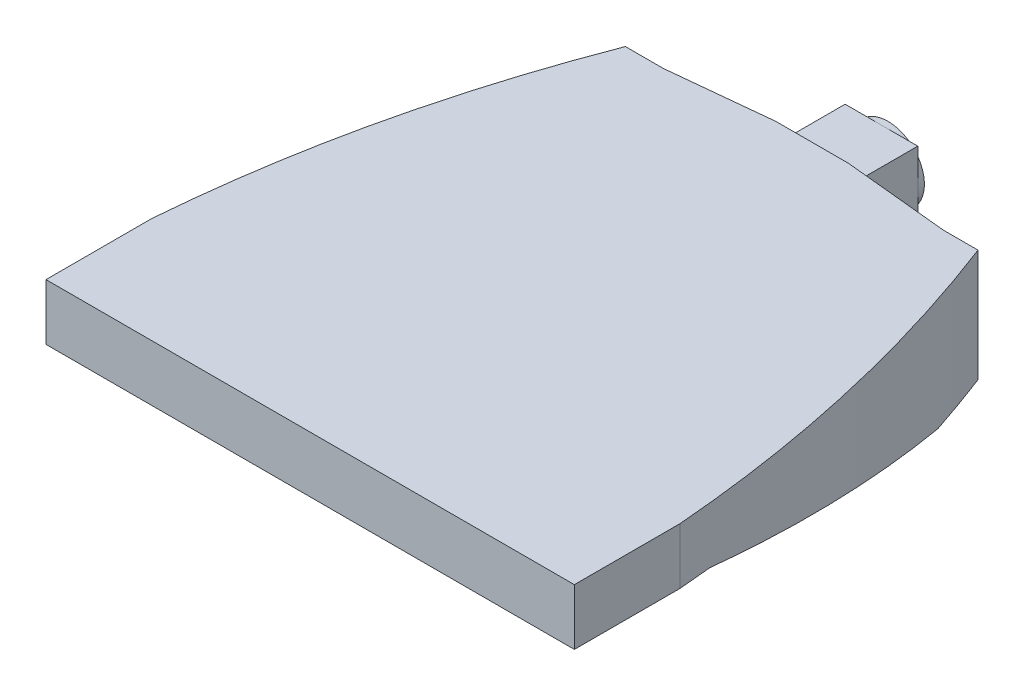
ISO-10303-21;
HEADER;
FILE_DESCRIPTION(('STEP AP214'),'2;1');
FILE_NAME('part.step','',(''),(''),'','','');
FILE_SCHEMA(('AUTOMOTIVE_DESIGN { 1 0 10303 214 1 1 1 1 }'));
ENDSEC;
DATA;
#1=APPLICATION_CONTEXT('core data for automotive mechanical design processes');
#2=APPLICATION_PROTOCOL_DEFINITION('international standard','automotive_design',2000,#1);
#3=PRODUCT_CONTEXT('',#1,'mechanical');
#4=PRODUCT('Part','Part','',(#3));
#5=PRODUCT_RELATED_PRODUCT_CATEGORY('part','',(#4));
#6=PRODUCT_DEFINITION_FORMATION('','',#4);
#7=PRODUCT_DEFINITION_CONTEXT('part definition',#1,'design');
#8=PRODUCT_DEFINITION('design','',#6,#7);
#9=PRODUCT_DEFINITION_SHAPE('','',#8);
#10=(LENGTH_UNIT() NAMED_UNIT(*) SI_UNIT(.MILLI.,.METRE.));
#11=(NAMED_UNIT(*) PLANE_ANGLE_UNIT() SI_UNIT($,.RADIAN.));
#12=(NAMED_UNIT(*) SI_UNIT($,.STERADIAN.) SOLID_ANGLE_UNIT());
#13=UNCERTAINTY_MEASURE_WITH_UNIT(LENGTH_MEASURE(1.E-05),#10,'distance_accuracy_value','');
#14=(GEOMETRIC_REPRESENTATION_CONTEXT(3) GLOBAL_UNCERTAINTY_ASSIGNED_CONTEXT((#13)) GLOBAL_UNIT_ASSIGNED_CONTEXT((#10,
#11,#12)) REPRESENTATION_CONTEXT('',''));
#15=CARTESIAN_POINT('',(0.,0.,0.));
#16=DIRECTION('',(0.,0.,1.));
#17=DIRECTION('',(1.,0.,0.));
#18=AXIS2_PLACEMENT_3D('',#15,#16,#17);
#19=CARTESIAN_POINT('',(5.29864247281,17.,-53.5149325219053));
#20=DIRECTION('',(0.0985306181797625,0.,-0.995134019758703));
#21=DIRECTION('',(-0.995134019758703,0.,-0.0985306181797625));
#22=AXIS2_PLACEMENT_3D('',#19,#20,#21);
#23=PLANE('',#22);
#24=DIRECTION('',(-0.995134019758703,0.,-0.0985306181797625));
#25=VECTOR('',#24,1.);
#26=CARTESIAN_POINT('',(5.29864247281,0.,-53.5149325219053));
#27=LINE('',#26,#25);
#28=CARTESIAN_POINT('',(35.9272027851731,0.,-50.4823249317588));
#29=VERTEX_POINT('',#28);
#30=CARTESIAN_POINT('',(20.,0.,-52.059315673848));
#31=VERTEX_POINT('',#30);
#32=EDGE_CURVE('E49',#29,#31,#27,.T.);
#33=ORIENTED_EDGE('',*,*,#32,.F.);
#34=DIRECTION('',(0.,-1.,0.));
#35=VECTOR('',#34,1.);
#36=CARTESIAN_POINT('',(35.9272027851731,17.,-50.4823249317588));
#37=LINE('',#36,#35);
#38=CARTESIAN_POINT('',(35.9272027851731,-17.,-50.4823249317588));
#39=VERTEX_POINT('',#38);
#40=EDGE_CURVE('E176',#29,#39,#37,.T.);
#41=ORIENTED_EDGE('',*,*,#40,.T.);
#42=DIRECTION('',(0.995134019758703,0.,0.0985306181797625));
#43=VECTOR('',#42,1.);
#44=CARTESIAN_POINT('',(5.29864247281,-17.,-53.5149325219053));
#45=LINE('',#44,#43);
#46=CARTESIAN_POINT('',(20.,-17.,-52.059315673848));
#47=VERTEX_POINT('',#46);
#48=EDGE_CURVE('E237',#47,#39,#45,.T.);
#49=ORIENTED_EDGE('',*,*,#48,.F.);
#50=DIRECTION('',(0.,1.,0.));
#51=VECTOR('',#50,1.);
#52=CARTESIAN_POINT('',(20.,-17.,-52.059315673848));
#53=LINE('',#52,#51);
#54=CARTESIAN_POINT('',(20.,-14.,-52.059315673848));
#55=VERTEX_POINT('',#54);
#56=EDGE_CURVE('E370',#47,#55,#53,.T.);
#57=ORIENTED_EDGE('',*,*,#56,.T.);
#58=CARTESIAN_POINT('',(20.,-3.,-52.059315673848));
#59=VERTEX_POINT('',#58);
#60=EDGE_CURVE('E367',#55,#59,#53,.T.);
#61=ORIENTED_EDGE('',*,*,#60,.T.);
#62=DIRECTION('',(0.,-1.,0.));
#63=VECTOR('',#62,1.);
#64=CARTESIAN_POINT('',(20.,0.,-52.059315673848));
#65=LINE('',#64,#63);
#66=EDGE_CURVE('E177',#31,#59,#65,.T.);
#67=ORIENTED_EDGE('',*,*,#66,.F.);
#68=EDGE_LOOP('',(#33,#41,#49,#57,#61,#67));
#69=FACE_BOUND('',#68,.T.);
#70=ADVANCED_FACE('F35',(#69),#23,.T.);
#71=CARTESIAN_POINT('',(-5.17366946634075,17.,-50.6104065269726));
#72=DIRECTION('',(-0.101695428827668,0.,-0.994815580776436));
#73=DIRECTION('',(-0.994815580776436,0.,0.101695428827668));
#74=AXIS2_PLACEMENT_3D('',#71,#72,#73);
#75=PLANE('',#74);
#76=DIRECTION('',(-0.994815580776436,0.,0.101695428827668));
#77=VECTOR('',#76,1.);
#78=CARTESIAN_POINT('',(-5.17366946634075,0.,-50.6104065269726));
#79=LINE('',#78,#77);
#80=CARTESIAN_POINT('',(9.00000000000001,0.,-52.059315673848));
#81=VERTEX_POINT('',#80);
#82=CARTESIAN_POINT('',(-6.42660254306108,0.,-50.4823249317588));
#83=VERTEX_POINT('',#82);
#84=EDGE_CURVE('E159',#81,#83,#79,.T.);
#85=ORIENTED_EDGE('',*,*,#84,.F.);
#86=DIRECTION('',(0.,-1.,0.));
#87=VECTOR('',#86,1.);
#88=CARTESIAN_POINT('',(9.00000000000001,0.,-52.059315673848));
#89=LINE('',#88,#87);
#90=CARTESIAN_POINT('',(9.00000000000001,-3.,-52.059315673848));
#91=VERTEX_POINT('',#90);
#92=EDGE_CURVE('E168',#81,#91,#89,.T.);
#93=ORIENTED_EDGE('',*,*,#92,.T.);
#94=DIRECTION('',(0.,1.,0.));
#95=VECTOR('',#94,1.);
#96=CARTESIAN_POINT('',(9.00000000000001,-17.,-52.059315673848));
#97=LINE('',#96,#95);
#98=CARTESIAN_POINT('',(9.00000000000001,-14.,-52.059315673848));
#99=VERTEX_POINT('',#98);
#100=EDGE_CURVE('E234',#99,#91,#97,.T.);
#101=ORIENTED_EDGE('',*,*,#100,.F.);
#102=CARTESIAN_POINT('',(9.00000000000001,-17.,-52.059315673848));
#103=VERTEX_POINT('',#102);
#104=EDGE_CURVE('E620',#103,#99,#97,.T.);
#105=ORIENTED_EDGE('',*,*,#104,.F.);
#106=DIRECTION('',(0.994815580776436,0.,-0.101695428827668));
#107=VECTOR('',#106,1.);
#108=CARTESIAN_POINT('',(-5.17366946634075,-17.,-50.6104065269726));
#109=LINE('',#108,#107);
#110=CARTESIAN_POINT('',(-6.42660254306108,-17.,-50.4823249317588));
#111=VERTEX_POINT('',#110);
#112=EDGE_CURVE('E243',#111,#103,#109,.T.);
#113=ORIENTED_EDGE('',*,*,#112,.F.);
#114=DIRECTION('',(0.,-1.,0.));
#115=VECTOR('',#114,1.);
#116=CARTESIAN_POINT('',(-6.42660254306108,17.,-50.4823249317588));
#117=LINE('',#116,#115);
#118=EDGE_CURVE('E42',#83,#111,#117,.T.);
#119=ORIENTED_EDGE('',*,*,#118,.F.);
#120=EDGE_LOOP('',(#85,#93,#101,#105,#113,#119));
#121=FACE_BOUND('',#120,.T.);
#122=ADVANCED_FACE('F166',(#121),#75,.T.);
#123=CARTESIAN_POINT('',(0.,17.,-50.4823249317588));
#124=DIRECTION('',(0.,0.,-1.));
#125=DIRECTION('',(-1.,0.,0.));
#126=AXIS2_PLACEMENT_3D('',#123,#124,#125);
#127=PLANE('',#126);
#128=DIRECTION('',(-1.,0.,0.));
#129=VECTOR('',#128,1.);
#130=CARTESIAN_POINT('',(0.,0.,-50.4823249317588));
#131=LINE('',#130,#129);
#132=CARTESIAN_POINT('',(-12.1947023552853,0.,-50.4823249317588));
#133=VERTEX_POINT('',#132);
#134=EDGE_CURVE('E384',#83,#133,#131,.T.);
#135=ORIENTED_EDGE('',*,*,#134,.F.);
#136=ORIENTED_EDGE('',*,*,#118,.T.);
#137=DIRECTION('',(1.,0.,0.));
#138=VECTOR('',#137,1.);
#139=CARTESIAN_POINT('',(0.,-17.,-50.4823249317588));
#140=LINE('',#139,#138);
#141=CARTESIAN_POINT('',(-12.1947023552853,-17.,-50.4823249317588));
#142=VERTEX_POINT('',#141);
#143=EDGE_CURVE('E246',#142,#111,#140,.T.);
#144=ORIENTED_EDGE('',*,*,#143,.F.);
#145=DIRECTION('',(0.,-1.,0.));
#146=VECTOR('',#145,1.);
#147=CARTESIAN_POINT('',(-12.1947023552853,17.,-50.4823249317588));
#148=LINE('',#147,#146);
#149=EDGE_CURVE('E611',#133,#142,#148,.T.);
#150=ORIENTED_EDGE('',*,*,#149,.F.);
#151=EDGE_LOOP('',(#135,#136,#144,#150));
#152=FACE_BOUND('',#151,.T.);
#153=ADVANCED_FACE('F205',(#152),#127,.T.);
#154=CARTESIAN_POINT('',(-25.5,17.,7.94068432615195));
#155=CARTESIAN_POINT('',(-23.0650337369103,17.,-22.2267649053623));
#156=CARTESIAN_POINT('',(-12.1947023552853,17.,-50.4823249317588));
#157=B_SPLINE_CURVE_WITH_KNOTS('',2,(#154,#155,#156),.UNSPECIFIED.,.F.,.F.,(3,3),(0.,1.),.UNSPECIFIED.);
#158=DIRECTION('',(0.,-1.,0.));
#159=VECTOR('',#158,1.);
#160=SURFACE_OF_LINEAR_EXTRUSION('',#157,#159);
#161=CARTESIAN_POINT('',(-25.5,0.,7.94068432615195));
#162=CARTESIAN_POINT('',(-23.0650337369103,0.,-22.2267649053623));
#163=CARTESIAN_POINT('',(-12.1947023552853,0.,-50.4823249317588));
#164=B_SPLINE_CURVE_WITH_KNOTS('',2,(#161,#162,#163),.UNSPECIFIED.,.F.,.F.,(3,3),(0.,1.),.UNSPECIFIED.);
#165=CARTESIAN_POINT('',(-25.5,0.,7.94068432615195));
#166=VERTEX_POINT('',#165);
#167=EDGE_CURVE('E387',#133,#166,#164,.F.);
#168=ORIENTED_EDGE('',*,*,#167,.F.);
#169=ORIENTED_EDGE('',*,*,#149,.T.);
#170=CARTESIAN_POINT('',(-25.5,-17.,7.94068432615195));
#171=CARTESIAN_POINT('',(-23.0650337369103,-17.,-22.2267649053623));
#172=CARTESIAN_POINT('',(-12.1947023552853,-17.,-50.4823249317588));
#173=B_SPLINE_CURVE_WITH_KNOTS('',2,(#170,#171,#172),.UNSPECIFIED.,.F.,.F.,(3,3),(0.,1.),.UNSPECIFIED.);
#174=CARTESIAN_POINT('',(-15.5783973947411,-17.,-41.0270976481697));
#175=VERTEX_POINT('',#174);
#176=EDGE_CURVE('E255',#175,#142,#173,.T.);
#177=ORIENTED_EDGE('',*,*,#176,.F.);
#178=CARTESIAN_POINT('',(-15.5783973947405,-17.0000000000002,-41.0270976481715));
#179=CARTESIAN_POINT('',(-16.1669456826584,-16.6566007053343,-39.2507713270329));
#180=CARTESIAN_POINT('',(-16.7316785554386,-16.3117296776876,-37.4668320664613));
#181=CARTESIAN_POINT('',(-17.8129404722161,-15.6192746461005,-33.884919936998));
#182=CARTESIAN_POINT('',(-18.3294693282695,-15.2716906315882,-32.0869470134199));
#183=CARTESIAN_POINT('',(-19.3123640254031,-14.5750220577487,-28.4832391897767));
#184=CARTESIAN_POINT('',(-19.7788666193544,-14.2259444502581,-26.677540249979));
#185=CARTESIAN_POINT('',(-20.6629592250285,-13.5255659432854,-23.0546417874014));
#186=CARTESIAN_POINT('',(-21.0805493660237,-13.1742650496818,-21.2374422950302));
#187=CARTESIAN_POINT('',(-21.871018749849,-12.465673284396,-17.5720585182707));
#188=CARTESIAN_POINT('',(-22.2433345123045,-12.1083597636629,-15.7237570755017));
#189=CARTESIAN_POINT('',(-22.9375165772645,-11.3919698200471,-12.0180350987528));
#190=CARTESIAN_POINT('',(-23.2593825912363,-11.0328933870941,-10.1606145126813));
#191=CARTESIAN_POINT('',(-23.8535066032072,-10.3122178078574,-6.43272391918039));
#192=CARTESIAN_POINT('',(-24.125620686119,-9.95061438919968,-4.56223181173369));
#193=CARTESIAN_POINT('',(-24.6192870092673,-9.22617008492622,-0.814846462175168));
#194=CARTESIAN_POINT('',(-24.8408398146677,-8.86332921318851,1.06204670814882));
#195=CARTESIAN_POINT('',(-25.0372044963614,-8.5,2.94146595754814));
#196=B_SPLINE_CURVE_WITH_KNOTS('',3,(#178,#179,#180,#181,#182,#183,#184,#185,#186,#187,#188,
#189,#190,#191,#192,#193,#194,#195),.UNSPECIFIED.,.F.,.F.,(4,2,2,2,2,2,2,2,4),(0.,
5.70745607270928,11.4149343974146,17.1063900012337,22.797830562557,28.5541017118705,
34.3104057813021,40.0831061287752,45.8557419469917),.UNSPECIFIED.);
#197=CARTESIAN_POINT('',(-25.0372044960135,-8.5,2.94146595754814));
#198=VERTEX_POINT('',#197);
#199=EDGE_CURVE('E276',#175,#198,#196,.T.);
#200=ORIENTED_EDGE('',*,*,#199,.T.);
#201=CARTESIAN_POINT('',(-25.5,-8.5,7.94068432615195));
#202=CARTESIAN_POINT('',(-23.0650337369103,-8.5,-22.2267649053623));
#203=CARTESIAN_POINT('',(-12.1947023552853,-8.5,-50.4823249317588));
#204=B_SPLINE_CURVE_WITH_KNOTS('',2,(#201,#202,#203),.UNSPECIFIED.,.F.,.F.,(3,3),(0.,1.),.UNSPECIFIED.);
#205=CARTESIAN_POINT('',(-25.5,-8.5,7.94068432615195));
#206=VERTEX_POINT('',#205);
#207=EDGE_CURVE('E284',#198,#206,#204,.F.);
#208=ORIENTED_EDGE('',*,*,#207,.T.);
#209=DIRECTION('',(0.,-1.,0.));
#210=VECTOR('',#209,1.);
#211=CARTESIAN_POINT('',(-25.5,17.,7.94068432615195));
#212=LINE('',#211,#210);
#213=EDGE_CURVE('E601',#166,#206,#212,.T.);
#214=ORIENTED_EDGE('',*,*,#213,.F.);
#215=EDGE_LOOP('',(#168,#169,#177,#200,#208,#214));
#216=FACE_BOUND('',#215,.T.);
#217=ADVANCED_FACE('F200',(#216),#160,.T.);
#218=CARTESIAN_POINT('',(-25.5,17.,0.));
#219=DIRECTION('',(-1.,0.,0.));
#220=DIRECTION('',(0.,0.,1.));
#221=AXIS2_PLACEMENT_3D('',#218,#219,#220);
#222=PLANE('',#221);
#223=DIRECTION('',(0.,0.,1.));
#224=VECTOR('',#223,1.);
#225=CARTESIAN_POINT('',(-25.5,0.,0.));
#226=LINE('',#225,#224);
#227=CARTESIAN_POINT('',(-25.5,0.,23.940684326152));
#228=VERTEX_POINT('',#227);
#229=EDGE_CURVE('E598',#166,#228,#226,.T.);
#230=ORIENTED_EDGE('',*,*,#229,.F.);
#231=ORIENTED_EDGE('',*,*,#213,.T.);
#232=DIRECTION('',(0.,0.,-1.));
#233=VECTOR('',#232,1.);
#234=CARTESIAN_POINT('',(-25.5,-8.5,0.));
#235=LINE('',#234,#233);
#236=CARTESIAN_POINT('',(-25.5,-8.5,23.940684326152));
#237=VERTEX_POINT('',#236);
#238=EDGE_CURVE('E628',#237,#206,#235,.T.);
#239=ORIENTED_EDGE('',*,*,#238,.F.);
#240=DIRECTION('',(0.,-1.,0.));
#241=VECTOR('',#240,1.);
#242=CARTESIAN_POINT('',(-25.5,17.,23.940684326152));
#243=LINE('',#242,#241);
#244=EDGE_CURVE('E603',#228,#237,#243,.T.);
#245=ORIENTED_EDGE('',*,*,#244,.F.);
#246=EDGE_LOOP('',(#230,#231,#239,#245));
#247=FACE_BOUND('',#246,.T.);
#248=ADVANCED_FACE('F204',(#247),#222,.T.);
#249=CARTESIAN_POINT('',(0.,17.,23.9406843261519));
#250=DIRECTION('',(0.,0.,-1.));
#251=DIRECTION('',(-1.,0.,0.));
#252=AXIS2_PLACEMENT_3D('',#249,#250,#251);
#253=PLANE('',#252);
#254=DIRECTION('',(0.,-1.,0.));
#255=VECTOR('',#254,1.);
#256=CARTESIAN_POINT('',(54.5,17.,23.9406843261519));
#257=LINE('',#256,#255);
#258=CARTESIAN_POINT('',(54.5,0.,23.9406843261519));
#259=VERTEX_POINT('',#258);
#260=CARTESIAN_POINT('',(54.5,-8.5,23.9406843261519));
#261=VERTEX_POINT('',#260);
#262=EDGE_CURVE('E614',#259,#261,#257,.T.);
#263=ORIENTED_EDGE('',*,*,#262,.F.);
#264=DIRECTION('',(-1.,0.,0.));
#265=VECTOR('',#264,1.);
#266=CARTESIAN_POINT('',(0.,0.,23.9406843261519));
#267=LINE('',#266,#265);
#268=EDGE_CURVE('E605',#259,#228,#267,.T.);
#269=ORIENTED_EDGE('',*,*,#268,.T.);
#270=ORIENTED_EDGE('',*,*,#244,.T.);
#271=DIRECTION('',(1.,0.,0.));
#272=VECTOR('',#271,1.);
#273=CARTESIAN_POINT('',(-25.5,-8.5,23.940684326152));
#274=LINE('',#273,#272);
#275=EDGE_CURVE('E625',#237,#261,#274,.T.);
#276=ORIENTED_EDGE('',*,*,#275,.T.);
#277=EDGE_LOOP('',(#263,#269,#270,#276));
#278=FACE_BOUND('',#277,.T.);
#279=ADVANCED_FACE('F528',(#278),#253,.F.);
#280=CARTESIAN_POINT('',(54.5,17.,0.));
#281=DIRECTION('',(-1.,0.,0.));
#282=DIRECTION('',(0.,0.,1.));
#283=AXIS2_PLACEMENT_3D('',#280,#281,#282);
#284=PLANE('',#283);
#285=DIRECTION('',(0.,-1.,0.));
#286=VECTOR('',#285,1.);
#287=CARTESIAN_POINT('',(54.5,17.,7.94068432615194));
#288=LINE('',#287,#286);
#289=CARTESIAN_POINT('',(54.5,0.,7.94068432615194));
#290=VERTEX_POINT('',#289);
#291=CARTESIAN_POINT('',(54.5,-8.5,7.94068432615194));
#292=VERTEX_POINT('',#291);
#293=EDGE_CURVE('E633',#290,#292,#288,.T.);
#294=ORIENTED_EDGE('',*,*,#293,.F.);
#295=DIRECTION('',(0.,0.,1.));
#296=VECTOR('',#295,1.);
#297=CARTESIAN_POINT('',(54.5,0.,0.));
#298=LINE('',#297,#296);
#299=EDGE_CURVE('E635',#290,#259,#298,.T.);
#300=ORIENTED_EDGE('',*,*,#299,.T.);
#301=ORIENTED_EDGE('',*,*,#262,.T.);
#302=DIRECTION('',(0.,0.,-1.));
#303=VECTOR('',#302,1.);
#304=CARTESIAN_POINT('',(54.5,-8.5,0.));
#305=LINE('',#304,#303);
#306=EDGE_CURVE('E386',#261,#292,#305,.T.);
#307=ORIENTED_EDGE('',*,*,#306,.T.);
#308=EDGE_LOOP('',(#294,#300,#301,#307));
#309=FACE_BOUND('',#308,.T.);
#310=ADVANCED_FACE('F517',(#309),#284,.F.);
#311=CARTESIAN_POINT('',(54.5,17.,7.94068432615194));
#312=CARTESIAN_POINT('',(52.0650337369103,17.,-22.2267649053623));
#313=CARTESIAN_POINT('',(41.1947023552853,17.,-50.4823249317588));
#314=B_SPLINE_CURVE_WITH_KNOTS('',2,(#311,#312,#313),.UNSPECIFIED.,.F.,.F.,(3,3),(0.,1.),.UNSPECIFIED.);
#315=DIRECTION('',(0.,-1.,0.));
#316=VECTOR('',#315,1.);
#317=SURFACE_OF_LINEAR_EXTRUSION('',#314,#316);
#318=DIRECTION('',(0.,-1.,0.));
#319=VECTOR('',#318,1.);
#320=CARTESIAN_POINT('',(41.1947023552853,17.,-50.4823249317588));
#321=LINE('',#320,#319);
#322=CARTESIAN_POINT('',(41.1947023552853,0.,-50.4823249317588));
#323=VERTEX_POINT('',#322);
#324=CARTESIAN_POINT('',(41.1947023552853,-17.,-50.4823249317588));
#325=VERTEX_POINT('',#324);
#326=EDGE_CURVE('E179',#323,#325,#321,.T.);
#327=ORIENTED_EDGE('',*,*,#326,.F.);
#328=CARTESIAN_POINT('',(54.5,0.,7.94068432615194));
#329=CARTESIAN_POINT('',(52.0650337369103,0.,-22.2267649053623));
#330=CARTESIAN_POINT('',(41.1947023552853,0.,-50.4823249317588));
#331=B_SPLINE_CURVE_WITH_KNOTS('',2,(#328,#329,#330),.UNSPECIFIED.,.F.,.F.,(3,3),(0.,1.),.UNSPECIFIED.);
#332=EDGE_CURVE('E637',#323,#290,#331,.F.);
#333=ORIENTED_EDGE('',*,*,#332,.T.);
#334=ORIENTED_EDGE('',*,*,#293,.T.);
#335=CARTESIAN_POINT('',(54.5,-8.5,7.94068432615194));
#336=CARTESIAN_POINT('',(52.0650337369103,-8.5,-22.2267649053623));
#337=CARTESIAN_POINT('',(41.1947023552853,-8.5,-50.4823249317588));
#338=B_SPLINE_CURVE_WITH_KNOTS('',2,(#335,#336,#337),.UNSPECIFIED.,.F.,.F.,(3,3),(0.,1.),.UNSPECIFIED.);
#339=CARTESIAN_POINT('',(54.0372044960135,-8.5,2.94146595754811));
#340=VERTEX_POINT('',#339);
#341=EDGE_CURVE('E184',#340,#292,#338,.F.);
#342=ORIENTED_EDGE('',*,*,#341,.F.);
#343=CARTESIAN_POINT('',(44.5783973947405,-17.0000000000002,-41.0270976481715));
#344=CARTESIAN_POINT('',(45.1669456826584,-16.6566007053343,-39.2507713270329));
#345=CARTESIAN_POINT('',(45.7316785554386,-16.3117296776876,-37.4668320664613));
#346=CARTESIAN_POINT('',(46.8129404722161,-15.6192746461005,-33.884919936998));
#347=CARTESIAN_POINT('',(47.3294693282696,-15.2716906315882,-32.0869470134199));
#348=CARTESIAN_POINT('',(48.3123640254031,-14.5750220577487,-28.4832391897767));
#349=CARTESIAN_POINT('',(48.7788666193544,-14.2259444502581,-26.677540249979));
#350=CARTESIAN_POINT('',(49.6629592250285,-13.5255659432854,-23.0546417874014));
#351=CARTESIAN_POINT('',(50.0805493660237,-13.1742650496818,-21.2374422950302));
#352=CARTESIAN_POINT('',(50.871018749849,-12.465673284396,-17.5720585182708));
#353=CARTESIAN_POINT('',(51.2433345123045,-12.1083597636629,-15.7237570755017));
#354=CARTESIAN_POINT('',(51.9375165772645,-11.3919698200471,-12.0180350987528));
#355=CARTESIAN_POINT('',(52.2593825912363,-11.0328933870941,-10.1606145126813));
#356=CARTESIAN_POINT('',(52.8535066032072,-10.3122178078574,-6.43272391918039));
#357=CARTESIAN_POINT('',(53.125620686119,-9.95061438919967,-4.56223181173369));
#358=CARTESIAN_POINT('',(53.6192870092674,-9.22617008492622,-0.814846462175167));
#359=CARTESIAN_POINT('',(53.8408398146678,-8.8633292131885,1.06204670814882));
#360=CARTESIAN_POINT('',(54.0372044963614,-8.49999999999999,2.94146595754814));
#361=B_SPLINE_CURVE_WITH_KNOTS('',3,(#343,#344,#345,#346,#347,#348,#349,#350,#351,#352,#353,
#354,#355,#356,#357,#358,#359,#360),.UNSPECIFIED.,.F.,.F.,(4,2,2,2,2,2,2,2,4),(0.,
5.70745607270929,11.4149343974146,17.1063900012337,22.797830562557,28.5541017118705,
34.3104057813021,40.0831061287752,45.8557419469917),.UNSPECIFIED.);
#362=CARTESIAN_POINT('',(44.5783973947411,-17.,-41.0270976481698));
#363=VERTEX_POINT('',#362);
#364=EDGE_CURVE('E285',#363,#340,#361,.T.);
#365=ORIENTED_EDGE('',*,*,#364,.F.);
#366=CARTESIAN_POINT('',(54.5,-17.,7.94068432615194));
#367=CARTESIAN_POINT('',(52.0650337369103,-17.,-22.2267649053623));
#368=CARTESIAN_POINT('',(41.1947023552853,-17.,-50.4823249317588));
#369=B_SPLINE_CURVE_WITH_KNOTS('',2,(#366,#367,#368),.UNSPECIFIED.,.F.,.F.,(3,3),(0.,1.),.UNSPECIFIED.);
#370=EDGE_CURVE('E235',#363,#325,#369,.T.);
#371=ORIENTED_EDGE('',*,*,#370,.T.);
#372=EDGE_LOOP('',(#327,#333,#334,#342,#365,#371));
#373=FACE_BOUND('',#372,.T.);
#374=ADVANCED_FACE('F507',(#373),#317,.F.);
#375=CARTESIAN_POINT('',(0.,17.,-50.4823249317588));
#376=DIRECTION('',(0.,0.,-1.));
#377=DIRECTION('',(-1.,0.,0.));
#378=AXIS2_PLACEMENT_3D('',#375,#376,#377);
#379=PLANE('',#378);
#380=DIRECTION('',(-1.,0.,0.));
#381=VECTOR('',#380,1.);
#382=CARTESIAN_POINT('',(0.,0.,-50.4823249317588));
#383=LINE('',#382,#381);
#384=EDGE_CURVE('E222',#323,#29,#383,.T.);
#385=ORIENTED_EDGE('',*,*,#384,.F.);
#386=ORIENTED_EDGE('',*,*,#326,.T.);
#387=DIRECTION('',(1.,0.,0.));
#388=VECTOR('',#387,1.);
#389=CARTESIAN_POINT('',(0.,-17.,-50.4823249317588));
#390=LINE('',#389,#388);
#391=EDGE_CURVE('E229',#39,#325,#390,.T.);
#392=ORIENTED_EDGE('',*,*,#391,.F.);
#393=ORIENTED_EDGE('',*,*,#40,.F.);
#394=EDGE_LOOP('',(#385,#386,#392,#393));
#395=FACE_BOUND('',#394,.T.);
#396=ADVANCED_FACE('F226',(#395),#379,.T.);
#397=CARTESIAN_POINT('',(9.00000000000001,0.,-52.059315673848));
#398=DIRECTION('',(0.,0.,1.));
#399=DIRECTION('',(1.,0.,0.));
#400=AXIS2_PLACEMENT_3D('',#397,#398,#399);
#401=PLANE('',#400);
#402=ORIENTED_EDGE('',*,*,#92,.F.);
#403=DIRECTION('',(1.,0.,0.));
#404=VECTOR('',#403,1.);
#405=CARTESIAN_POINT('',(9.00000000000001,0.,-52.059315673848));
#406=LINE('',#405,#404);
#407=EDGE_CURVE('E11',#81,#31,#406,.T.);
#408=ORIENTED_EDGE('',*,*,#407,.T.);
#409=ORIENTED_EDGE('',*,*,#66,.T.);
#410=DIRECTION('',(1.,0.,0.));
#411=VECTOR('',#410,1.);
#412=CARTESIAN_POINT('',(9.00000000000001,-3.,-52.059315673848));
#413=LINE('',#412,#411);
#414=EDGE_CURVE('E174',#91,#59,#413,.T.);
#415=ORIENTED_EDGE('',*,*,#414,.F.);
#416=EDGE_LOOP('',(#402,#408,#409,#415));
#417=FACE_BOUND('',#416,.T.);
#418=ADVANCED_FACE('F172',(#417),#401,.F.);
#419=CARTESIAN_POINT('',(0.,-17.,-62.559315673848));
#420=DIRECTION('',(0.,0.,-1.));
#421=DIRECTION('',(-1.,0.,0.));
#422=AXIS2_PLACEMENT_3D('',#419,#420,#421);
#423=PLANE('',#422);
#424=CARTESIAN_POINT('',(14.5,-8.5,-62.559315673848));
#425=DIRECTION('',(0.,0.,1.));
#426=DIRECTION('',(-1.,0.,0.));
#427=AXIS2_PLACEMENT_3D('',#424,#425,#426);
#428=CIRCLE('',#427,5.5);
#429=CARTESIAN_POINT('',(8.99999999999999,-8.5,-62.559315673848));
#430=VERTEX_POINT('',#429);
#431=CARTESIAN_POINT('',(14.5,-14.,-62.559315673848));
#432=VERTEX_POINT('',#431);
#433=EDGE_CURVE('E342',#430,#432,#428,.T.);
#434=ORIENTED_EDGE('',*,*,#433,.T.);
#435=DIRECTION('',(1.,0.,0.));
#436=VECTOR('',#435,1.);
#437=CARTESIAN_POINT('',(9.00000000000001,-14.,-62.5593156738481));
#438=LINE('',#437,#436);
#439=CARTESIAN_POINT('',(9.00000000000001,-14.,-62.5593156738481));
#440=VERTEX_POINT('',#439);
#441=EDGE_CURVE('E250',#440,#432,#438,.T.);
#442=ORIENTED_EDGE('',*,*,#441,.F.);
#443=DIRECTION('',(0.,1.,0.));
#444=VECTOR('',#443,1.);
#445=CARTESIAN_POINT('',(9.00000000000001,-17.,-62.559315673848));
#446=LINE('',#445,#444);
#447=EDGE_CURVE('E330',#440,#430,#446,.T.);
#448=ORIENTED_EDGE('',*,*,#447,.T.);
#449=EDGE_LOOP('',(#434,#442,#448));
#450=FACE_BOUND('',#449,.T.);
#451=ADVANCED_FACE('F325',(#450),#423,.T.);
#452=CARTESIAN_POINT('',(20.,-8.5,-62.5593156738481));
#453=VERTEX_POINT('',#452);
#454=EDGE_CURVE('E181',#432,#453,#428,.T.);
#455=ORIENTED_EDGE('',*,*,#454,.T.);
#456=DIRECTION('',(0.,1.,0.));
#457=VECTOR('',#456,1.);
#458=CARTESIAN_POINT('',(20.,-17.,-62.5593156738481));
#459=LINE('',#458,#457);
#460=CARTESIAN_POINT('',(20.,-14.,-62.5593156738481));
#461=VERTEX_POINT('',#460);
#462=EDGE_CURVE('E364',#461,#453,#459,.T.);
#463=ORIENTED_EDGE('',*,*,#462,.F.);
#464=EDGE_CURVE('E344',#432,#461,#438,.T.);
#465=ORIENTED_EDGE('',*,*,#464,.F.);
#466=EDGE_LOOP('',(#455,#463,#465));
#467=FACE_BOUND('',#466,.T.);
#468=ADVANCED_FACE('F391',(#467),#423,.T.);
#469=CARTESIAN_POINT('',(14.5,-3.,-62.559315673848));
#470=VERTEX_POINT('',#469);
#471=EDGE_CURVE('E360',#453,#470,#428,.T.);
#472=ORIENTED_EDGE('',*,*,#471,.T.);
#473=DIRECTION('',(1.,0.,0.));
#474=VECTOR('',#473,1.);
#475=CARTESIAN_POINT('',(9.00000000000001,-3.,-62.5593156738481));
#476=LINE('',#475,#474);
#477=CARTESIAN_POINT('',(20.,-3.,-62.5593156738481));
#478=VERTEX_POINT('',#477);
#479=EDGE_CURVE('E353',#470,#478,#476,.T.);
#480=ORIENTED_EDGE('',*,*,#479,.T.);
#481=EDGE_CURVE('E56',#453,#478,#459,.T.);
#482=ORIENTED_EDGE('',*,*,#481,.F.);
#483=EDGE_LOOP('',(#472,#480,#482));
#484=FACE_BOUND('',#483,.T.);
#485=ADVANCED_FACE('F326',(#484),#423,.T.);
#486=CARTESIAN_POINT('',(20.,-17.,0.));
#487=DIRECTION('',(1.,0.,0.));
#488=DIRECTION('',(0.,0.,-1.));
#489=AXIS2_PLACEMENT_3D('',#486,#487,#488);
#490=PLANE('',#489);
#491=DIRECTION('',(0.,0.,1.));
#492=VECTOR('',#491,1.);
#493=CARTESIAN_POINT('',(20.,-2.99999999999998,0.));
#494=LINE('',#493,#492);
#495=EDGE_CURVE('E355',#478,#59,#494,.T.);
#496=ORIENTED_EDGE('',*,*,#495,.T.);
#497=ORIENTED_EDGE('',*,*,#60,.F.);
#498=DIRECTION('',(0.,0.,1.));
#499=VECTOR('',#498,1.);
#500=CARTESIAN_POINT('',(20.,-14.,0.));
#501=LINE('',#500,#499);
#502=EDGE_CURVE('E347',#461,#55,#501,.T.);
#503=ORIENTED_EDGE('',*,*,#502,.F.);
#504=ORIENTED_EDGE('',*,*,#462,.T.);
#505=ORIENTED_EDGE('',*,*,#481,.T.);
#506=EDGE_LOOP('',(#496,#497,#503,#504,#505));
#507=FACE_BOUND('',#506,.T.);
#508=ADVANCED_FACE('F323',(#507),#490,.T.);
#509=EDGE_CURVE('E374',#470,#430,#428,.T.);
#510=ORIENTED_EDGE('',*,*,#509,.T.);
#511=CARTESIAN_POINT('',(9.00000000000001,-3.,-62.5593156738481));
#512=VERTEX_POINT('',#511);
#513=EDGE_CURVE('E335',#430,#512,#446,.T.);
#514=ORIENTED_EDGE('',*,*,#513,.T.);
#515=EDGE_CURVE('E351',#512,#470,#476,.T.);
#516=ORIENTED_EDGE('',*,*,#515,.T.);
#517=EDGE_LOOP('',(#510,#514,#516));
#518=FACE_BOUND('',#517,.T.);
#519=ADVANCED_FACE('F318',(#518),#423,.T.);
#520=CARTESIAN_POINT('',(9.00000000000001,-17.,0.));
#521=DIRECTION('',(1.,0.,0.));
#522=DIRECTION('',(0.,0.,-1.));
#523=AXIS2_PLACEMENT_3D('',#520,#521,#522);
#524=PLANE('',#523);
#525=ORIENTED_EDGE('',*,*,#447,.F.);
#526=DIRECTION('',(0.,0.,1.));
#527=VECTOR('',#526,1.);
#528=CARTESIAN_POINT('',(9.00000000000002,-14.,0.));
#529=LINE('',#528,#527);
#530=EDGE_CURVE('E333',#440,#99,#529,.T.);
#531=ORIENTED_EDGE('',*,*,#530,.T.);
#532=ORIENTED_EDGE('',*,*,#100,.T.);
#533=DIRECTION('',(0.,0.,1.));
#534=VECTOR('',#533,1.);
#535=CARTESIAN_POINT('',(9.00000000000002,-2.99999999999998,0.));
#536=LINE('',#535,#534);
#537=EDGE_CURVE('E357',#512,#91,#536,.T.);
#538=ORIENTED_EDGE('',*,*,#537,.F.);
#539=ORIENTED_EDGE('',*,*,#513,.F.);
#540=EDGE_LOOP('',(#525,#531,#532,#538,#539));
#541=FACE_BOUND('',#540,.T.);
#542=ADVANCED_FACE('F273',(#541),#524,.F.);
#543=CARTESIAN_POINT('',(0.,-17.,0.));
#544=DIRECTION('',(0.,-1.,0.));
#545=DIRECTION('',(0.,0.,1.));
#546=AXIS2_PLACEMENT_3D('',#543,#544,#545);
#547=PLANE('',#546);
#548=DIRECTION('',(-1.,0.,0.));
#549=VECTOR('',#548,1.);
#550=CARTESIAN_POINT('',(0.,-17.,-41.0270976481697));
#551=LINE('',#550,#549);
#552=EDGE_CURVE('E371',#363,#175,#551,.T.);
#553=ORIENTED_EDGE('',*,*,#552,.T.);
#554=ORIENTED_EDGE('',*,*,#176,.T.);
#555=ORIENTED_EDGE('',*,*,#143,.T.);
#556=ORIENTED_EDGE('',*,*,#112,.T.);
#557=DIRECTION('',(1.,0.,0.));
#558=VECTOR('',#557,1.);
#559=CARTESIAN_POINT('',(9.00000000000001,-17.,-52.059315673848));
#560=LINE('',#559,#558);
#561=EDGE_CURVE('E240',#103,#47,#560,.T.);
#562=ORIENTED_EDGE('',*,*,#561,.T.);
#563=ORIENTED_EDGE('',*,*,#48,.T.);
#564=ORIENTED_EDGE('',*,*,#391,.T.);
#565=ORIENTED_EDGE('',*,*,#370,.F.);
#566=EDGE_LOOP('',(#553,#554,#555,#556,#562,#563,#564,#565));
#567=FACE_BOUND('',#566,.T.);
#568=ADVANCED_FACE('F238',(#567),#547,.T.);
#569=CARTESIAN_POINT('',(9.00000000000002,-14.,0.));
#570=DIRECTION('',(0.,-1.,0.));
#571=DIRECTION('',(0.,0.,1.));
#572=AXIS2_PLACEMENT_3D('',#569,#570,#571);
#573=PLANE('',#572);
#574=ORIENTED_EDGE('',*,*,#502,.T.);
#575=DIRECTION('',(1.,0.,0.));
#576=VECTOR('',#575,1.);
#577=CARTESIAN_POINT('',(9.00000000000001,-14.,-52.059315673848));
#578=LINE('',#577,#576);
#579=EDGE_CURVE('E244',#99,#55,#578,.T.);
#580=ORIENTED_EDGE('',*,*,#579,.F.);
#581=ORIENTED_EDGE('',*,*,#530,.F.);
#582=ORIENTED_EDGE('',*,*,#441,.T.);
#583=ORIENTED_EDGE('',*,*,#464,.T.);
#584=EDGE_LOOP('',(#574,#580,#581,#582,#583));
#585=FACE_BOUND('',#584,.T.);
#586=ADVANCED_FACE('F310',(#585),#573,.T.);
#587=CARTESIAN_POINT('',(9.00000000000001,0.,-52.059315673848));
#588=DIRECTION('',(0.,0.,1.));
#589=DIRECTION('',(1.,0.,0.));
#590=AXIS2_PLACEMENT_3D('',#587,#588,#589);
#591=PLANE('',#590);
#592=ORIENTED_EDGE('',*,*,#56,.F.);
#593=ORIENTED_EDGE('',*,*,#561,.F.);
#594=ORIENTED_EDGE('',*,*,#104,.T.);
#595=ORIENTED_EDGE('',*,*,#579,.T.);
#596=EDGE_LOOP('',(#592,#593,#594,#595));
#597=FACE_BOUND('',#596,.T.);
#598=ADVANCED_FACE('F306',(#597),#591,.F.);
#599=CARTESIAN_POINT('',(9.00000000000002,-2.99999999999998,0.));
#600=DIRECTION('',(0.,-1.,0.));
#601=DIRECTION('',(0.,0.,1.));
#602=AXIS2_PLACEMENT_3D('',#599,#600,#601);
#603=PLANE('',#602);
#604=ORIENTED_EDGE('',*,*,#495,.F.);
#605=ORIENTED_EDGE('',*,*,#479,.F.);
#606=ORIENTED_EDGE('',*,*,#515,.F.);
#607=ORIENTED_EDGE('',*,*,#537,.T.);
#608=ORIENTED_EDGE('',*,*,#414,.T.);
#609=EDGE_LOOP('',(#604,#605,#606,#607,#608));
#610=FACE_BOUND('',#609,.T.);
#611=ADVANCED_FACE('F302',(#610),#603,.F.);
#612=CARTESIAN_POINT('',(-25.5,-8.5,0.));
#613=DIRECTION('',(0.,1.,0.));
#614=DIRECTION('',(0.,0.,-1.));
#615=AXIS2_PLACEMENT_3D('',#612,#613,#614);
#616=PLANE('',#615);
#617=ORIENTED_EDGE('',*,*,#207,.F.);
#618=DIRECTION('',(1.,0.,0.));
#619=VECTOR('',#618,1.);
#620=CARTESIAN_POINT('',(-25.5,-8.5,2.94146595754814));
#621=LINE('',#620,#619);
#622=EDGE_CURVE('E624',#198,#340,#621,.T.);
#623=ORIENTED_EDGE('',*,*,#622,.T.);
#624=ORIENTED_EDGE('',*,*,#341,.T.);
#625=ORIENTED_EDGE('',*,*,#306,.F.);
#626=ORIENTED_EDGE('',*,*,#275,.F.);
#627=ORIENTED_EDGE('',*,*,#238,.T.);
#628=EDGE_LOOP('',(#617,#623,#624,#625,#626,#627));
#629=FACE_BOUND('',#628,.T.);
#630=ADVANCED_FACE('F299',(#629),#616,.F.);
#631=CARTESIAN_POINT('',(-25.5,-8.74193518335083,1.68999036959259));
#632=DIRECTION('',(0.,0.981821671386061,-0.189805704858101));
#633=DIRECTION('',(0.,-0.189805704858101,-0.981821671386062));
#634=AXIS2_PLACEMENT_3D('',#631,#632,#633);
#635=PLANE('',#634);
#636=ORIENTED_EDGE('',*,*,#199,.F.);
#637=ORIENTED_EDGE('',*,*,#552,.F.);
#638=ORIENTED_EDGE('',*,*,#364,.T.);
#639=ORIENTED_EDGE('',*,*,#622,.F.);
#640=EDGE_LOOP('',(#636,#637,#638,#639));
#641=FACE_BOUND('',#640,.T.);
#642=ADVANCED_FACE('F293',(#641),#635,.F.);
#643=CARTESIAN_POINT('',(14.5,-8.5,-63.559315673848));
#644=DIRECTION('',(0.,0.,1.));
#645=DIRECTION('',(1.,0.,0.));
#646=AXIS2_PLACEMENT_3D('',#643,#644,#645);
#647=CYLINDRICAL_SURFACE('',#646,5.5);
#648=CARTESIAN_POINT('',(14.5,-8.5,-63.559315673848));
#649=DIRECTION('',(0.,0.,1.));
#650=DIRECTION('',(-1.,0.,0.));
#651=AXIS2_PLACEMENT_3D('',#648,#649,#650);
#652=CIRCLE('',#651,5.5);
#653=CARTESIAN_POINT('',(8.99999999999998,-8.5,-63.559315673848));
#654=VERTEX_POINT('',#653);
#655=EDGE_CURVE('E383',#654,#654,#652,.T.);
#656=ORIENTED_EDGE('',*,*,#655,.T.);
#657=EDGE_LOOP('',(#656));
#658=FACE_BOUND('',#657,.T.);
#659=ORIENTED_EDGE('',*,*,#433,.F.);
#660=ORIENTED_EDGE('',*,*,#509,.F.);
#661=ORIENTED_EDGE('',*,*,#471,.F.);
#662=ORIENTED_EDGE('',*,*,#454,.F.);
#663=EDGE_LOOP('',(#659,#660,#661,#662));
#664=FACE_BOUND('',#663,.T.);
#665=ADVANCED_FACE('F298',(#658,#664),#647,.T.);
#666=CARTESIAN_POINT('',(14.5,-8.5,-63.559315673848));
#667=DIRECTION('',(0.,0.,-1.));
#668=DIRECTION('',(-1.,0.,0.));
#669=AXIS2_PLACEMENT_3D('',#666,#667,#668);
#670=PLANE('',#669);
#671=ORIENTED_EDGE('',*,*,#655,.F.);
#672=EDGE_LOOP('',(#671));
#673=FACE_BOUND('',#672,.T.);
#674=ADVANCED_FACE('F394',(#673),#670,.T.);
#675=CARTESIAN_POINT('',(0.,0.,0.));
#676=DIRECTION('',(0.,-1.,0.));
#677=DIRECTION('',(0.,0.,-1.));
#678=AXIS2_PLACEMENT_3D('',#675,#676,#677);
#679=PLANE('',#678);
#680=ORIENTED_EDGE('',*,*,#134,.T.);
#681=ORIENTED_EDGE('',*,*,#167,.T.);
#682=ORIENTED_EDGE('',*,*,#229,.T.);
#683=ORIENTED_EDGE('',*,*,#268,.F.);
#684=ORIENTED_EDGE('',*,*,#299,.F.);
#685=ORIENTED_EDGE('',*,*,#332,.F.);
#686=ORIENTED_EDGE('',*,*,#384,.T.);
#687=ORIENTED_EDGE('',*,*,#32,.T.);
#688=ORIENTED_EDGE('',*,*,#407,.F.);
#689=ORIENTED_EDGE('',*,*,#84,.T.);
#690=EDGE_LOOP('',(#680,#681,#682,#683,#684,#685,#686,#687,#688,#689));
#691=FACE_BOUND('',#690,.T.);
#692=ADVANCED_FACE('F158',(#691),#679,.F.);
#693=CLOSED_SHELL('',(#70,#122,#153,#217,#248,#279,#310,#374,#396,#418,#451,#468,#485,#508,#519,
#542,#568,#586,#598,#611,#630,#642,#665,#674,#692));
#694=MANIFOLD_SOLID_BREP('B2',#693);
#695=ADVANCED_BREP_SHAPE_REPRESENTATION('',(#18,#694),#14);
#696=SHAPE_DEFINITION_REPRESENTATION(#9,#695);
ENDSEC;
END-ISO-10303-21;
